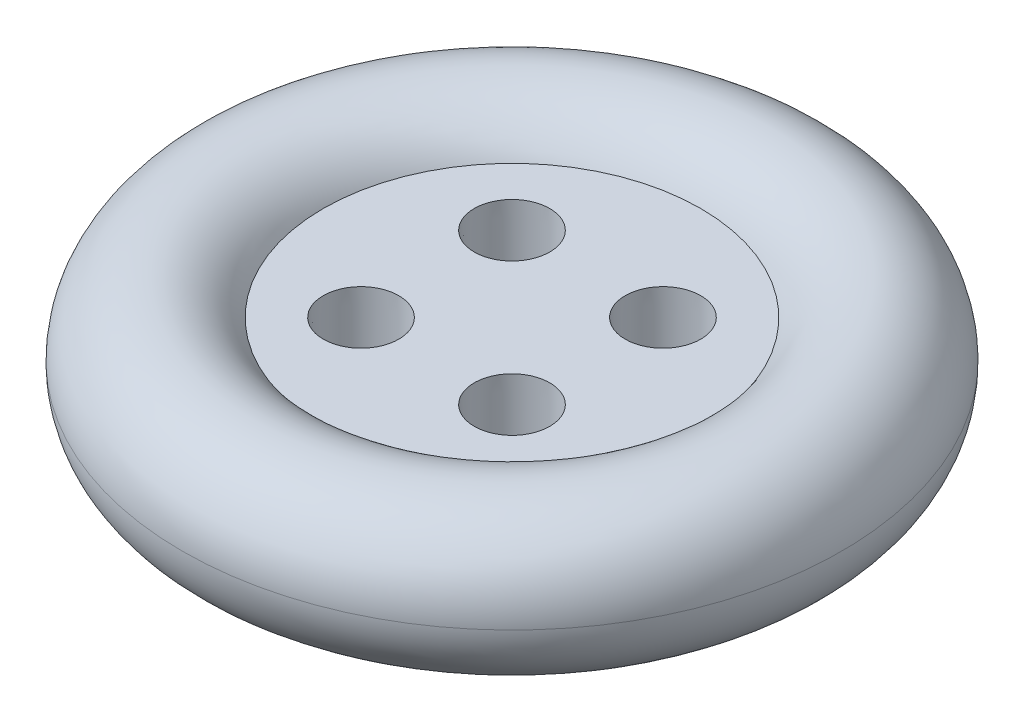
ISO-10303-21;
HEADER;
FILE_DESCRIPTION(('STEP AP214'),'2;1');
FILE_NAME('part.step','',(''),(''),'','','');
FILE_SCHEMA(('AUTOMOTIVE_DESIGN { 1 0 10303 214 1 1 1 1 }'));
ENDSEC;
DATA;
#1=APPLICATION_CONTEXT('core data for automotive mechanical design processes');
#2=APPLICATION_PROTOCOL_DEFINITION('international standard','automotive_design',2000,#1);
#3=PRODUCT_CONTEXT('',#1,'mechanical');
#4=PRODUCT('Part','Part','',(#3));
#5=PRODUCT_RELATED_PRODUCT_CATEGORY('part','',(#4));
#6=PRODUCT_DEFINITION_FORMATION('','',#4);
#7=PRODUCT_DEFINITION_CONTEXT('part definition',#1,'design');
#8=PRODUCT_DEFINITION('design','',#6,#7);
#9=PRODUCT_DEFINITION_SHAPE('','',#8);
#10=(LENGTH_UNIT() NAMED_UNIT(*) SI_UNIT(.MILLI.,.METRE.));
#11=(NAMED_UNIT(*) PLANE_ANGLE_UNIT() SI_UNIT($,.RADIAN.));
#12=(NAMED_UNIT(*) SI_UNIT($,.STERADIAN.) SOLID_ANGLE_UNIT());
#13=UNCERTAINTY_MEASURE_WITH_UNIT(LENGTH_MEASURE(1.E-05),#10,'distance_accuracy_value','');
#14=(GEOMETRIC_REPRESENTATION_CONTEXT(3) GLOBAL_UNCERTAINTY_ASSIGNED_CONTEXT((#13)) GLOBAL_UNIT_ASSIGNED_CONTEXT((#10,
#11,#12)) REPRESENTATION_CONTEXT('',''));
#15=CARTESIAN_POINT('',(0.,0.,0.));
#16=DIRECTION('',(0.,0.,1.));
#17=DIRECTION('',(1.,0.,0.));
#18=AXIS2_PLACEMENT_3D('',#15,#16,#17);
#19=CARTESIAN_POINT('',(0.,0.,0.));
#20=DIRECTION('',(0.,1.,0.));
#21=DIRECTION('',(0.,0.,1.));
#22=AXIS2_PLACEMENT_3D('',#19,#20,#21);
#23=TOROIDAL_SURFACE('',#22,26.9282032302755,8.);
#24=CARTESIAN_POINT('',(0.,-4.,0.));
#25=DIRECTION('',(0.,1.,0.));
#26=DIRECTION('',(0.,0.,1.));
#27=AXIS2_PLACEMENT_3D('',#24,#25,#26);
#28=CIRCLE('',#27,20.);
#29=CARTESIAN_POINT('',(0.,-4.,20.));
#30=VERTEX_POINT('',#29);
#31=EDGE_CURVE('E39',#30,#30,#28,.T.);
#32=ORIENTED_EDGE('',*,*,#31,.T.);
#33=EDGE_LOOP('',(#32));
#34=FACE_BOUND('',#33,.T.);
#35=CARTESIAN_POINT('',(0.,0.,0.));
#36=DIRECTION('',(0.,-1.,0.));
#37=DIRECTION('',(0.,0.,-1.));
#38=AXIS2_PLACEMENT_3D('',#35,#36,#37);
#39=CIRCLE('',#38,34.9282032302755);
#40=CARTESIAN_POINT('',(0.,0.,-34.9282032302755));
#41=VERTEX_POINT('',#40);
#42=EDGE_CURVE('E10',#41,#41,#39,.T.);
#43=ORIENTED_EDGE('',*,*,#42,.T.);
#44=EDGE_LOOP('',(#43));
#45=FACE_BOUND('',#44,.T.);
#46=ADVANCED_FACE('F32',(#34,#45),#23,.T.);
#47=CARTESIAN_POINT('',(0.,-4.,0.));
#48=DIRECTION('',(0.,1.,0.));
#49=DIRECTION('',(0.,0.,1.));
#50=AXIS2_PLACEMENT_3D('',#47,#48,#49);
#51=PLANE('',#50);
#52=CARTESIAN_POINT('',(-8.,-4.,-7.99999999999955));
#53=DIRECTION('',(0.,1.,0.));
#54=DIRECTION('',(0.,0.,1.));
#55=AXIS2_PLACEMENT_3D('',#52,#53,#54);
#56=CIRCLE('',#55,3.86035948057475);
#57=CARTESIAN_POINT('',(-8.,-4.,-4.1396405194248));
#58=VERTEX_POINT('',#57);
#59=EDGE_CURVE('E67',#58,#58,#56,.T.);
#60=ORIENTED_EDGE('',*,*,#59,.T.);
#61=EDGE_LOOP('',(#60));
#62=FACE_BOUND('',#61,.T.);
#63=CARTESIAN_POINT('',(-7.99999999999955,-4.,8.00000000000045));
#64=DIRECTION('',(0.,1.,0.));
#65=DIRECTION('',(0.,0.,1.));
#66=AXIS2_PLACEMENT_3D('',#63,#64,#65);
#67=CIRCLE('',#66,3.8603594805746);
#68=CARTESIAN_POINT('',(-7.99999999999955,-4.,11.860359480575));
#69=VERTEX_POINT('',#68);
#70=EDGE_CURVE('E61',#69,#69,#67,.T.);
#71=ORIENTED_EDGE('',*,*,#70,.T.);
#72=EDGE_LOOP('',(#71));
#73=FACE_BOUND('',#72,.T.);
#74=CARTESIAN_POINT('',(8.00000000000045,-4.,8.));
#75=DIRECTION('',(0.,1.,0.));
#76=DIRECTION('',(0.,0.,1.));
#77=AXIS2_PLACEMENT_3D('',#74,#75,#76);
#78=CIRCLE('',#77,3.86035948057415);
#79=CARTESIAN_POINT('',(8.00000000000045,-4.,11.8603594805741));
#80=VERTEX_POINT('',#79);
#81=EDGE_CURVE('E55',#80,#80,#78,.T.);
#82=ORIENTED_EDGE('',*,*,#81,.T.);
#83=EDGE_LOOP('',(#82));
#84=FACE_BOUND('',#83,.T.);
#85=CARTESIAN_POINT('',(8.,-4.,-8.));
#86=DIRECTION('',(0.,1.,0.));
#87=DIRECTION('',(0.,0.,1.));
#88=AXIS2_PLACEMENT_3D('',#85,#86,#87);
#89=CIRCLE('',#88,3.86035948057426);
#90=CARTESIAN_POINT('',(8.,-4.,-4.13964051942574));
#91=VERTEX_POINT('',#90);
#92=EDGE_CURVE('E47',#91,#91,#89,.T.);
#93=ORIENTED_EDGE('',*,*,#92,.T.);
#94=EDGE_LOOP('',(#93));
#95=FACE_BOUND('',#94,.T.);
#96=ORIENTED_EDGE('',*,*,#31,.F.);
#97=EDGE_LOOP('',(#96));
#98=FACE_BOUND('',#97,.T.);
#99=ADVANCED_FACE('F34',(#62,#73,#84,#95,#98),#51,.F.);
#100=ORIENTED_EDGE('',*,*,#42,.F.);
#101=EDGE_LOOP('',(#100));
#102=FACE_BOUND('',#101,.T.);
#103=CARTESIAN_POINT('',(0.,4.,0.));
#104=DIRECTION('',(0.,1.,0.));
#105=DIRECTION('',(0.,0.,1.));
#106=AXIS2_PLACEMENT_3D('',#103,#104,#105);
#107=CIRCLE('',#106,20.);
#108=CARTESIAN_POINT('',(0.,4.,20.));
#109=VERTEX_POINT('',#108);
#110=EDGE_CURVE('E43',#109,#109,#107,.T.);
#111=ORIENTED_EDGE('',*,*,#110,.F.);
#112=EDGE_LOOP('',(#111));
#113=FACE_BOUND('',#112,.T.);
#114=ADVANCED_FACE('F81',(#102,#113),#23,.T.);
#115=CARTESIAN_POINT('',(0.,4.,0.));
#116=DIRECTION('',(0.,-1.,0.));
#117=DIRECTION('',(0.,0.,-1.));
#118=AXIS2_PLACEMENT_3D('',#115,#116,#117);
#119=PLANE('',#118);
#120=CARTESIAN_POINT('',(-8.,4.,-7.99999999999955));
#121=DIRECTION('',(0.,1.,0.));
#122=DIRECTION('',(0.,0.,1.));
#123=AXIS2_PLACEMENT_3D('',#120,#121,#122);
#124=CIRCLE('',#123,4.00000000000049);
#125=CARTESIAN_POINT('',(-8.,4.,-3.99999999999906));
#126=VERTEX_POINT('',#125);
#127=EDGE_CURVE('E70',#126,#126,#124,.T.);
#128=ORIENTED_EDGE('',*,*,#127,.F.);
#129=EDGE_LOOP('',(#128));
#130=FACE_BOUND('',#129,.T.);
#131=CARTESIAN_POINT('',(-7.99999999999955,4.,8.00000000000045));
#132=DIRECTION('',(0.,1.,0.));
#133=DIRECTION('',(0.,0.,1.));
#134=AXIS2_PLACEMENT_3D('',#131,#132,#133);
#135=CIRCLE('',#134,4.00000000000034);
#136=CARTESIAN_POINT('',(-7.99999999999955,4.,12.0000000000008));
#137=VERTEX_POINT('',#136);
#138=EDGE_CURVE('E64',#137,#137,#135,.T.);
#139=ORIENTED_EDGE('',*,*,#138,.F.);
#140=EDGE_LOOP('',(#139));
#141=FACE_BOUND('',#140,.T.);
#142=CARTESIAN_POINT('',(8.00000000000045,4.,8.));
#143=DIRECTION('',(0.,1.,0.));
#144=DIRECTION('',(0.,0.,1.));
#145=AXIS2_PLACEMENT_3D('',#142,#143,#144);
#146=CIRCLE('',#145,3.99999999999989);
#147=CARTESIAN_POINT('',(8.00000000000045,4.,11.9999999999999));
#148=VERTEX_POINT('',#147);
#149=EDGE_CURVE('E58',#148,#148,#146,.T.);
#150=ORIENTED_EDGE('',*,*,#149,.F.);
#151=EDGE_LOOP('',(#150));
#152=FACE_BOUND('',#151,.T.);
#153=CARTESIAN_POINT('',(8.,4.,-8.));
#154=DIRECTION('',(0.,1.,0.));
#155=DIRECTION('',(0.,0.,1.));
#156=AXIS2_PLACEMENT_3D('',#153,#154,#155);
#157=CIRCLE('',#156,4.);
#158=CARTESIAN_POINT('',(8.,4.,-4.));
#159=VERTEX_POINT('',#158);
#160=EDGE_CURVE('E52',#159,#159,#157,.T.);
#161=ORIENTED_EDGE('',*,*,#160,.F.);
#162=EDGE_LOOP('',(#161));
#163=FACE_BOUND('',#162,.T.);
#164=ORIENTED_EDGE('',*,*,#110,.T.);
#165=EDGE_LOOP('',(#164));
#166=FACE_BOUND('',#165,.T.);
#167=ADVANCED_FACE('F77',(#130,#141,#152,#163,#166),#119,.F.);
#168=CARTESIAN_POINT('',(8.,4.,-8.));
#169=DIRECTION('',(0.,1.,0.));
#170=DIRECTION('',(0.,0.,1.));
#171=AXIS2_PLACEMENT_3D('',#168,#169,#170);
#172=CONICAL_SURFACE('',#171,4.,0.0174532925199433);
#173=ORIENTED_EDGE('',*,*,#160,.T.);
#174=EDGE_LOOP('',(#173));
#175=FACE_BOUND('',#174,.T.);
#176=ORIENTED_EDGE('',*,*,#92,.F.);
#177=EDGE_LOOP('',(#176));
#178=FACE_BOUND('',#177,.T.);
#179=ADVANCED_FACE('F80',(#175,#178),#172,.F.);
#180=CARTESIAN_POINT('',(8.00000000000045,4.,8.));
#181=DIRECTION('',(0.,1.,0.));
#182=DIRECTION('',(0.,0.,1.));
#183=AXIS2_PLACEMENT_3D('',#180,#181,#182);
#184=CONICAL_SURFACE('',#183,3.99999999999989,0.0174532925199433);
#185=ORIENTED_EDGE('',*,*,#149,.T.);
#186=EDGE_LOOP('',(#185));
#187=FACE_BOUND('',#186,.T.);
#188=ORIENTED_EDGE('',*,*,#81,.F.);
#189=EDGE_LOOP('',(#188));
#190=FACE_BOUND('',#189,.T.);
#191=ADVANCED_FACE('F128',(#187,#190),#184,.F.);
#192=CARTESIAN_POINT('',(-7.99999999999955,4.,8.00000000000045));
#193=DIRECTION('',(0.,1.,0.));
#194=DIRECTION('',(0.,0.,1.));
#195=AXIS2_PLACEMENT_3D('',#192,#193,#194);
#196=CONICAL_SURFACE('',#195,4.00000000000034,0.0174532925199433);
#197=ORIENTED_EDGE('',*,*,#138,.T.);
#198=EDGE_LOOP('',(#197));
#199=FACE_BOUND('',#198,.T.);
#200=ORIENTED_EDGE('',*,*,#70,.F.);
#201=EDGE_LOOP('',(#200));
#202=FACE_BOUND('',#201,.T.);
#203=ADVANCED_FACE('F139',(#199,#202),#196,.F.);
#204=CARTESIAN_POINT('',(-8.,4.,-7.99999999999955));
#205=DIRECTION('',(0.,1.,0.));
#206=DIRECTION('',(0.,0.,1.));
#207=AXIS2_PLACEMENT_3D('',#204,#205,#206);
#208=CONICAL_SURFACE('',#207,4.00000000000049,0.0174532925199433);
#209=ORIENTED_EDGE('',*,*,#127,.T.);
#210=EDGE_LOOP('',(#209));
#211=FACE_BOUND('',#210,.T.);
#212=ORIENTED_EDGE('',*,*,#59,.F.);
#213=EDGE_LOOP('',(#212));
#214=FACE_BOUND('',#213,.T.);
#215=ADVANCED_FACE('F74',(#211,#214),#208,.F.);
#216=CLOSED_SHELL('',(#46,#99,#114,#167,#179,#191,#203,#215));
#217=MANIFOLD_SOLID_BREP('B2',#216);
#218=ADVANCED_BREP_SHAPE_REPRESENTATION('',(#18,#217),#14);
#219=SHAPE_DEFINITION_REPRESENTATION(#9,#218);
ENDSEC;
END-ISO-10303-21;
